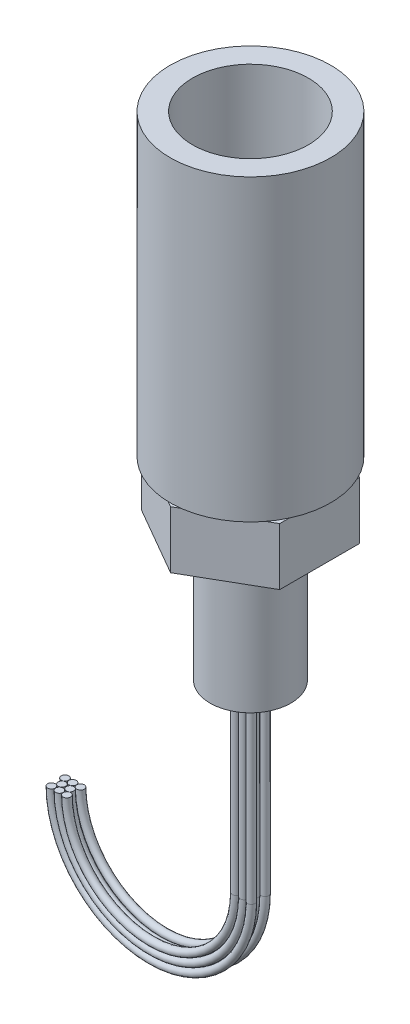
from build123d import *

# Parameters (mm, degrees)
EXTRUDE1_DEPTH    = 7.874
SKETCH3_R         = 7.875
EXTRUDE2_DEPTH    = 10.41
SKETCH4_R         = 0.955
EXTRUDE8_DEPTH    = 10.41
CIRPATTERN1_COUNT = 8
SKETCH_1_R        = 0.955
EXTRUDE9_DEPTH    = 10.41
SKETCH8_R         = 5.55625
EXTRUDE7_DEPTH    = 18.28030303
SKETCH9_R         = 0.89
SKETCH11_R        = 0.5207
EXTRUDE10_DEPTH   = 25.4
SKETCH12_R        = 0.5207
REVOLVE2_ANGLE    = 180


with BuildPart() as part:
    # Sketch1 → Extrude1 (new body)
    with BuildSketch(Plane(origin=(0, 0, 0), x_dir=(1, 0, 0), z_dir=(0, 1, 0))):
        Polygon((0, 10.998522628), (-9.525, 5.499261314), (-9.525, -5.499261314), (0, -10.998522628), (9.525, -5.499261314), (9.525, 5.499261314), align=None)
    extrude(amount=EXTRUDE1_DEPTH)

    # Sketch2 → Revolve1 (revolve)
    with BuildSketch(Plane.XY, mode=Mode.PRIVATE) as revolve1_sk:
        Polygon((8.8011, 7.874), (8.8011, 11.6586), (9.398, 11.6586), (9.398, 13.2334), (8.8011, 13.2334), (8.8011, 14.8844), (9.398, 14.8844), (9.398, 16.4592), (8.8011, 16.4592), (8.8011, 17.272), (0, 17.272), (0, 7.874), align=None)
    revolve(revolve1_sk.sketch.rotate(Axis((0, 0, 0), (0, -1, 0)), 180), axis=Axis((0, 0, 0), (0, -1, 0)))

    # Sketch3 → Extrude2 (add)
    with BuildSketch(Plane(origin=(0, 17.272, 0), x_dir=(-1, 0, 0), z_dir=(0, 1, 0))):
        with Locations(Location((0, 0, 0), (0, 0, 180))):
            Circle(SKETCH3_R)
    extrude(amount=EXTRUDE2_DEPTH)

    # Sketch4 → Extrude8 (cut)
    with BuildSketch(Plane(origin=(0, 27.682, 0), x_dir=(-1, 0, 0), z_dir=(0, 1, 0))):
        with Locations((0, -5.08)):
            Circle(SKETCH4_R)
    extrude8 = extrude(amount=-EXTRUDE8_DEPTH, mode=Mode.SUBTRACT)

    # CirPattern1: Extrude8 ×8 about axis, 1 skipped
    cirpattern1_axis = Axis((0, 0, 0), (0, -1, 0))
    add([extrude8.rotate(cirpattern1_axis, i * 360 / CIRPATTERN1_COUNT) for i in range(1, CIRPATTERN1_COUNT) if i not in (4,)], mode=Mode.SUBTRACT)

    # Sketch 1 → Extrude9 (cut)
    with BuildSketch(Plane(origin=(0.09953018, 27.682, 4.480198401), x_dir=(-1, 0, 0), z_dir=(0, 1, 0))):
        with Locations((0.09953018, -2.570198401)):
            Circle(SKETCH_1_R)
    extrude(amount=-EXTRUDE9_DEPTH, mode=Mode.SUBTRACT)

    # Sketch8 → Extrude7 (add)
    with BuildSketch(Plane.XZ):
        with Locations(Location((0, 0, 0), (0, 0, 90))):
            Circle(SKETCH8_R)
    extrude(amount=EXTRUDE7_DEPTH)

    # Sketch9 → o-ring 12.42x1.78 (revolve)
    with BuildSketch(Plane.XY, mode=Mode.PRIVATE) as o_ring_12_42x1_78_sk:
        with Locations((7.1, 0.284318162)):
            Circle(SKETCH9_R)
    revolve(o_ring_12_42x1_78_sk.sketch.rotate(Axis((0, 0, 0), (0, -1, 0)), 90), axis=Axis((0, 0, 0), (0, -1, 0)))

    # Sketch10 → Locking sleeve (revolve)
    with BuildSketch(Plane.XY, mode=Mode.PRIVATE) as locking_sleeve_sk:
        Polygon((9.0805, 8.362288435), (9.0805, 11.435688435), (9.594035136, 11.435688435), (9.594035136, 13.086688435), (9.0805, 13.086688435), (9.0805, 14.610688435), (9.594035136, 14.610688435), (9.594035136, 18.010776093), (7.9756, 18.010776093), (7.9756, 49.510288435), (11.049, 49.510288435), (11.049, 8.362288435), align=None)
    revolve(locking_sleeve_sk.sketch.rotate(Axis((0, 0, 0), (0, -1, 0)), 180), axis=Axis((0, 0, 0), (0, -1, 0)))

    # Sketch11 → Extrude10 (add)
    with BuildSketch(Plane.XZ.offset(18.28030303)):
        with Locations(Location((0, 0.908738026, 0), (0, 0, 270))):
            Circle(SKETCH11_R)
        with Locations(Location((0.5588, 0, 0), (0, 0, 270))):
            Circle(SKETCH11_R)
        with Locations(Location((0, -0.908738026, 0), (0, 0, 270))):
            Circle(SKETCH11_R)
        with Locations(Location((-0.5588, 0, 0), (0, 0, 270))):
            Circle(SKETCH11_R)
        with Locations(Location((1.0668, 0.938082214, 0), (0, 0, 270))):
            Circle(SKETCH11_R)
        with Locations(Location((-1.066390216, 0.938304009, 0), (0, 0, 270))):
            Circle(SKETCH11_R)
        with Locations(Location((-1.0668, -0.938082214, 0), (0, 0, 270))):
            Circle(SKETCH11_R)
        with Locations(Location((1.066390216, -0.938304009, 0), (0, 0, 270))):
            Circle(SKETCH11_R)
    extrude(amount=EXTRUDE10_DEPTH)

    # Sketch12 → Revolve2 (revolve)
    with BuildSketch(Plane.XZ.offset(43.68030303)):
        with Locations((0.5588, 0)):
            Circle(SKETCH12_R)
        with Locations((1.066390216, -0.938304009)):
            Circle(SKETCH12_R)
        with Locations((0, -0.908738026)):
            Circle(SKETCH12_R)
        with Locations((-1.0668, -0.938082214)):
            Circle(SKETCH12_R)
        with Locations((-0.5588, 0)):
            Circle(SKETCH12_R)
        with Locations((-1.066390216, 0.938304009)):
            Circle(SKETCH12_R)
        with Locations((0, 0.908738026)):
            Circle(SKETCH12_R)
        with Locations((1.0668, 0.938082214)):
            Circle(SKETCH12_R)
    revolve(axis=Axis((-12.7, -43.68030303, 9.80089633), (0, 0, -1)), revolution_arc=REVOLVE2_ANGLE)


solid = part.part
